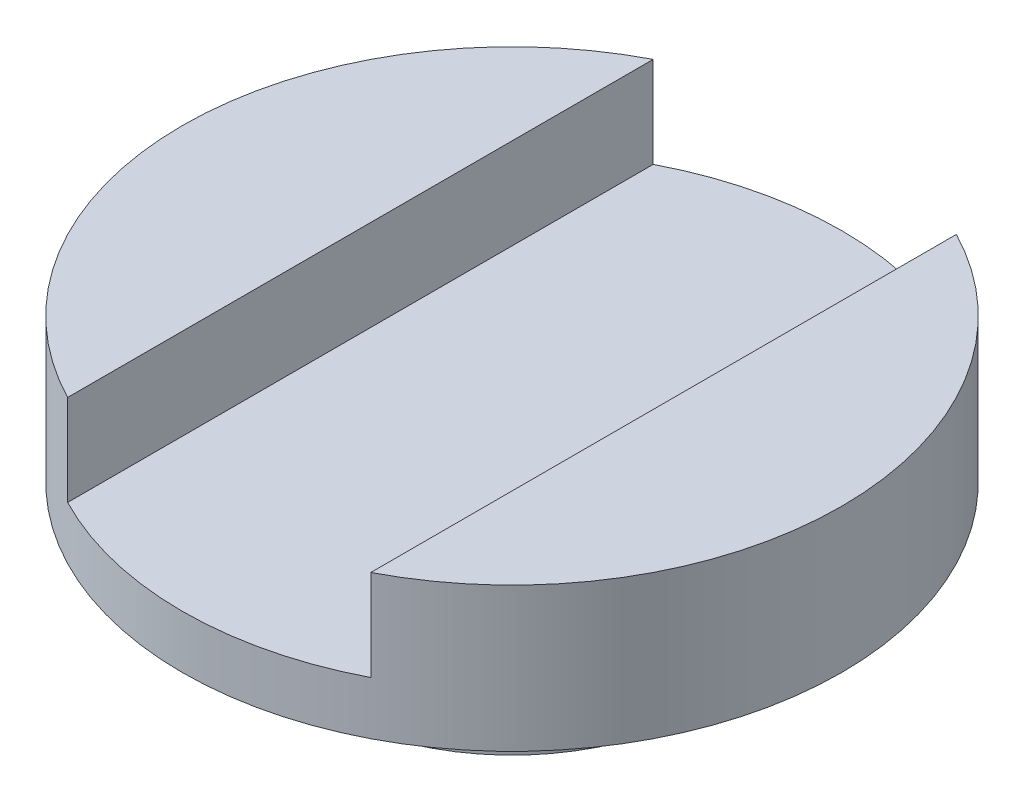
from build123d import *

# Parameters (mm, degrees)
CUT_EXTRUDE1_DEPTH      = 70.459070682
CUT_EXTRUDE1_DEPTH_BACK = 70.459070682
SKETCH2_W               = 40
SKETCH2_H               = 12


with BuildPart() as part:
    # Sketch1 → Revolve1 (revolve)
    with BuildSketch(Plane.XY, mode=Mode.PRIVATE) as revolve1_sk:
        with BuildLine():
            Line((0, 0), (25.375, 0))
            Line((25.375, 0), (25.375, 2))
            Line((25.375, 2), (21.564488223, 8.6))
            ThreePointArc((21.564488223, 8.6), (21.564488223, 10.2), (22.950128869, 11))
            Line((22.950128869, 11), (25.375, 11))
            Line((25.375, 11), (25.375, 13.25))
            Line((25.375, 13.25), (43.5, 13.25))
            Line((43.5, 13.25), (43.5, 32.25))
            Line((43.5, 32.25), (0, 32.25))
            Line((0, 32.25), (0, 0))
        make_face()
    revolve(revolve1_sk.sketch.rotate(Axis((0, 0, 0), (0, 1, 0)), 90), axis=Axis((0, 0, 0), (0, 1, 0)))

    # Sketch2 → Cut-Extrude1 (cut, two sides: drawn at the far end of the back side and taken through both)
    with BuildSketch(Plane.XY.offset(-CUT_EXTRUDE1_DEPTH_BACK)):
        with Locations((0, 26.25)):
            Rectangle(SKETCH2_W, SKETCH2_H)
    extrude(amount=CUT_EXTRUDE1_DEPTH + CUT_EXTRUDE1_DEPTH_BACK, mode=Mode.SUBTRACT)


solid = part.part
